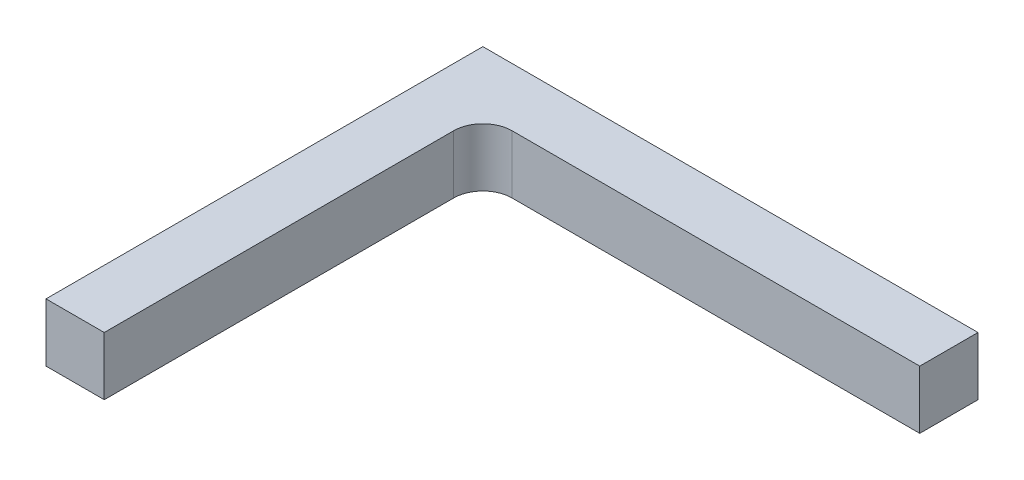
from build123d import *

# Parameters (mm, degrees)
ESTRUSIONE_ESTRUSIONE1_DEPTH = 200
ESTRUSIONE_ESTRUSIONE2_START = 200
SCHIZZO2_R                   = 40
ESTRUSIONE_ESTRUSIONE2_DEPTH = 50
RACCORDO1_R                  = 100
CORPO_SPOSTA_COPIA1_ANGLE    = 90


with BuildPart() as part:
    # Schizzo1 → Estrusione-Estrusione1 (new body)
    with BuildSketch(Plane.XY):
        Polygon((0, 0), (200, 0), (200, -1300), (1700, -1300), (1700, -1500), (0, -1500), align=None)
    extrude(amount=ESTRUSIONE_ESTRUSIONE1_DEPTH)

    # Schizzo2 → Estrusione-Estrusione2 (add)
    with BuildSketch(Plane.XY.offset(ESTRUSIONE_ESTRUSIONE2_START)):
        with Locations(Location((100, -900, 0), (0, 0, 180))):
            Circle(SCHIZZO2_R)
        with Locations(Location((100, -500, 0), (0, 0, 180))):
            Circle(SCHIZZO2_R)
    extrude(amount=ESTRUSIONE_ESTRUSIONE2_DEPTH)

    # Raccordo1
    raccordo1_edges = [part.edges().sort_by_distance(p)[0] for p in [
        (200, -1300, 100),
    ]]
    fillet(raccordo1_edges, radius=RACCORDO1_R)


with BuildPart() as part_1:
    # Corpo-Sposta_copia1: moved
    add(part.part.rotate(Axis((0, -1250, 125), (1, 0, 0)), CORPO_SPOSTA_COPIA1_ANGLE))


solid = part_1.part
